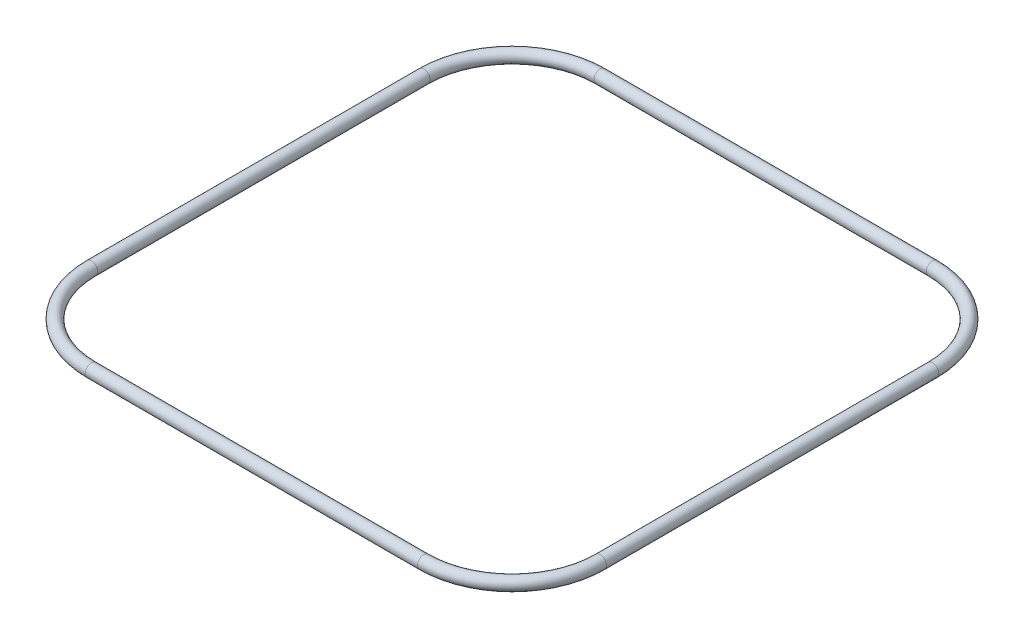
from build123d import *

# Parameters (mm, degrees)
PROFILE_R = 0.889


with BuildPart() as part:
    # Sweep1: sweep along a path in path
    with BuildLine(Plane(origin=(0, 0, 0), x_dir=(1, 0, 0), z_dir=(0, 1, 0))) as sweep1_path:
        Line((-23.4445, 71.778), (23.4445, 71.778))
        ThreePointArc((23.4445, 71.778), (32.244090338, 68.133090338), (35.889, 59.3335))
        Line((35.889, 59.3335), (35.889, 12.4445))
        ThreePointArc((35.889, 12.4445), (32.244090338, 3.644909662), (23.4445, 0))
        Line((23.4445, 0), (-23.4445, 0))
        ThreePointArc((-23.4445, 0), (-32.244090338, 3.644909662), (-35.889, 12.4445))
        Line((-35.889, 12.4445), (-35.889, 59.3335))
        ThreePointArc((-35.889, 59.3335), (-32.244090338, 68.133090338), (-23.4445, 71.778))
    # profile → Sweep1 (sweep)
    with BuildSketch(Plane(origin=(0, 0, 0), x_dir=(0, 0, -1), z_dir=(1, 0, 0))):
        Circle(PROFILE_R)
    sweep(path=sweep1_path.line)


solid = part.part
